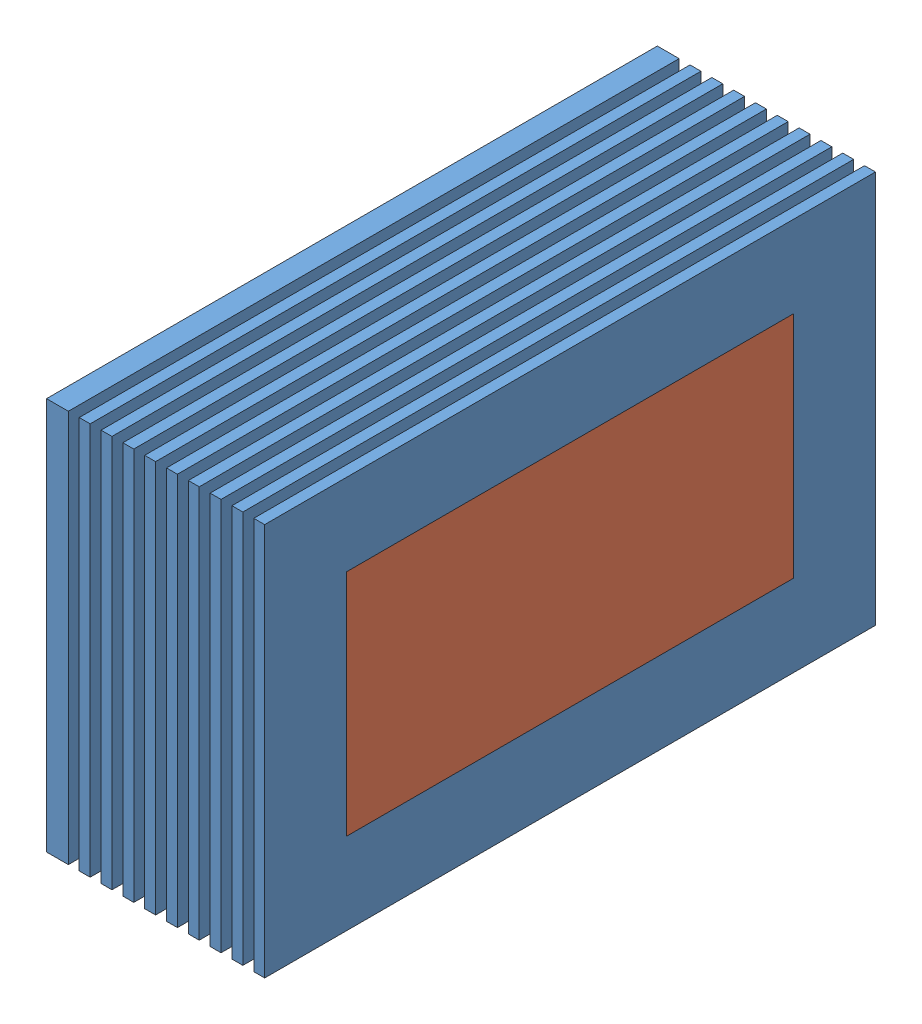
SolidWorks assembly integrated coil 1.SLDASM, configuration 默认 (file format 15000). Lengths in mm.
Overall size (2.18 3.6 5.6).
4 component instances, 3 part files, 9 mates.
Components (placement in the parent):
- coil_2-1: coil_2.SLDPRT [默认] at (0.3628 -1.7081 5.6) size (2 3.6 5.6)
- Iron_plate_optimized_2-1: Iron_plate_optimized_2.SLDPRT [默认] at (0.3628 -0.9581 5.6) size (2 2.1 4.1) (hidden)
- small iron ball-1: small iron ball.SLDPRT [默认] at (0.3628 0.0419 6.65) x (0.996725 -0.079787 0.013181) z (-0.014188 -0.012072 0.999826) size (2 2 2)
- small iron ball-2: small iron ball.SLDPRT [默认] at (0.3628 0.0419 4.65) size (2 2 2)
Mates (geometry in assembly coordinates):
- 重合1: coincident anti-aligned: plane of coil_2-1 through (1.3628 1.1419 7.65) normal (0 -1 0); plane of Iron_plate_optimized_2-1 through (0.3628 1.1419 5.6) normal (0 1 0)
- 重合2: coincident anti-aligned: plane of coil_2-1 through (1.3628 -0.9581 3.55) normal (0 0 1); plane of Iron_plate_optimized_2-1 through (-0.6372 1.1419 3.55) normal (0 0 -1)
- 重合3: coincident aligned: plane of coil_2-1 through (1.3628 1.8919 8.4) normal (1 0 0); plane of Iron_plate_optimized_2-1 through (1.3628 1.1419 7.65) normal (1 0 0)
- 相切1: tangent anti-aligned: plane of coil_2-1 through (1.3628 -0.9581 7.65) normal (0 0 -1); sphere of small iron ball-1
- 相切3: tangent aligned: plane of coil_2-1 through (1.3628 1.8919 8.4) normal (1 0 0); sphere of small iron ball-1
- 相切4: tangent anti-aligned: plane of coil_2-1 through (1.3628 -0.9581 7.65) normal (0 1 0); sphere of small iron ball-1
- 相切5: tangent anti-aligned: sphere of small iron ball-1; sphere of small iron ball-2
- 相切6: tangent aligned: plane of coil_2-1 through (1.3628 1.8919 8.4) normal (1 0 0); sphere of small iron ball-2
- 相切7: tangent anti-aligned: plane of coil_2-1 through (1.3628 -0.9581 7.65) normal (0 1 0); sphere of small iron ball-2
